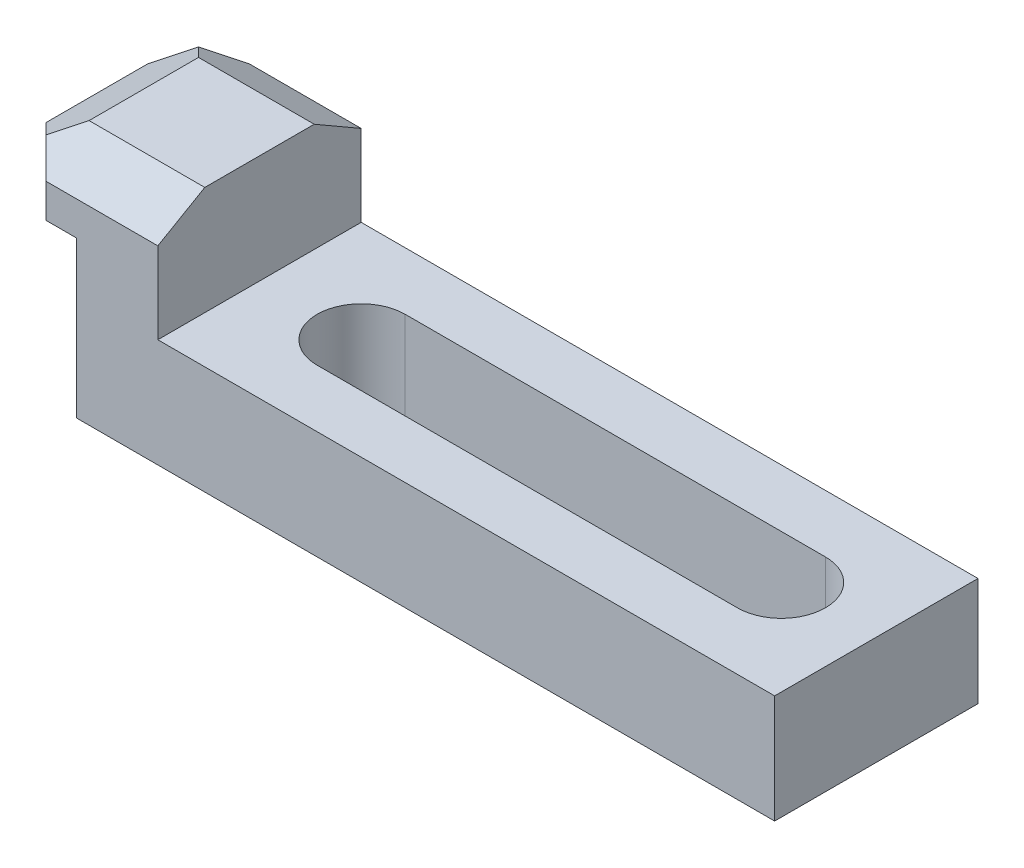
from build123d import *
from OCP.BRepFilletAPI import BRepFilletAPI_MakeChamfer

# Parameters (mm, degrees)
EXTRUDE1_DEPTH = 15
CHAMFER1_SIZE  = 4
CHAMFER1_SIZE2 = 6.92820323
EXTRUDE2_DEPTH = 121.307938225


with BuildPart() as part:
    # Sketch1 → Extrude1 (new, symmetric)
    with BuildSketch(Plane.XY):
        Polygon((0, 0), (12, 0), (12, -23), (115, -23), (115, -7), (24, -7), (24, 9), (0, 9), align=None)
    extrude(amount=EXTRUDE1_DEPTH, both=True)

    # Chamfer1: one chamfer whose edges measure the first distance from different faces: ONE call of the kernel's chamfer builder (chamfer() names one face for all edges)
    chamfer1_edges_1 = [part.edges().sort_by_distance(p)[0] for p in [
        (0, 9, 0),
    ]]
    chamfer1_side_1 = [part.faces().sort_by_distance(p)[0] for p in [
        (0, 4.5, 0),
    ]]
    chamfer1_edges_2 = [part.edges().sort_by_distance(p)[0] for p in [
        (12, 9, 15),
    ]]
    chamfer1_side_2 = [part.faces().sort_by_distance(p)[0] for p in [
        (55.8275154, -12.341889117, 15),
    ]]
    chamfer1_edges_3 = [part.edges().sort_by_distance(p)[0] for p in [
        (12, 9, -15),
    ]]
    chamfer1_side_3 = [part.faces().sort_by_distance(p)[0] for p in [
        (55.8275154, -12.341889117, -15),
    ]]
    chamfer1 = BRepFilletAPI_MakeChamfer(part.part.solid().wrapped)
    for e in chamfer1_edges_1:
        chamfer1.Add(CHAMFER1_SIZE, CHAMFER1_SIZE2, e.wrapped, chamfer1_side_1[0].wrapped)  # the first distance lies on this face
    for e in chamfer1_edges_2:
        chamfer1.Add(CHAMFER1_SIZE, CHAMFER1_SIZE2, e.wrapped, chamfer1_side_2[0].wrapped)  # the first distance lies on this face
    for e in chamfer1_edges_3:
        chamfer1.Add(CHAMFER1_SIZE, CHAMFER1_SIZE2, e.wrapped, chamfer1_side_3[0].wrapped)  # the first distance lies on this face
    add(Compound.cast(chamfer1.Shape()), mode=Mode.REPLACE)

    # Sketch2 → Extrude2 (cut, through all)
    with BuildSketch(Plane.XZ.offset(23)):
        with BuildLine():
            Line((39, 6.5), (101, 6.5))
            ThreePointArc((101, 6.5), (107.5, 0), (101, -6.5))
            Line((101, -6.5), (39, -6.5))
            ThreePointArc((39, -6.5), (32.5, 0), (39, 6.5))
        make_face()
        Polygon((0, 15), (7.5, 15), (0, 7.5), align=None)
        Polygon((0, -7.5), (0, -15), (7.5, -15), align=None)
    extrude(amount=-EXTRUDE2_DEPTH, mode=Mode.SUBTRACT)


solid = part.part
